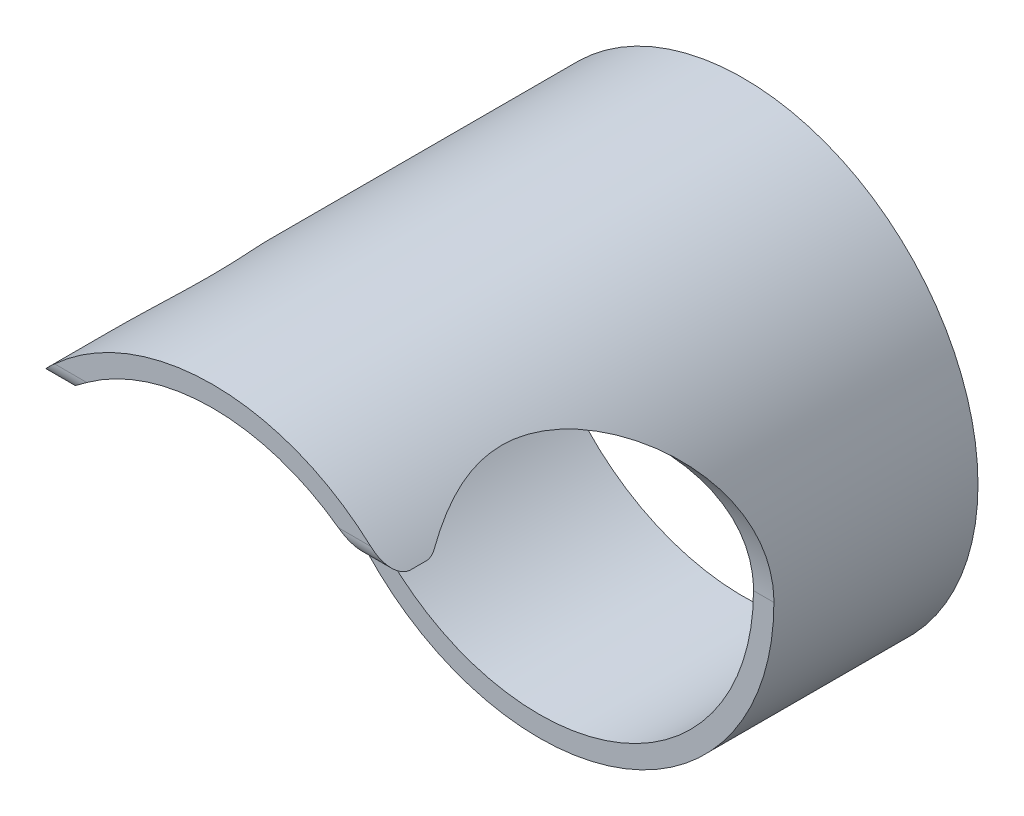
from build123d import *

# Parameters (mm, degrees)
ESQUISSE1_R           = 57.5
ESQUISSE1_R_2         = 52.5
EXTRUSION1_DEPTH      = 130
EXTRUSION2_DEPTH      = 154.337862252
EXTRUSION2_DEPTH_BACK = 154.337862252
CONG_1_R              = 5


with BuildPart() as part:
    # Esquisse1 → Extrusion1 (new body)
    with BuildSketch(Plane.XY):
        Circle(ESQUISSE1_R)
        Circle(ESQUISSE1_R_2, mode=Mode.SUBTRACT)
    extrude(amount=EXTRUSION1_DEPTH)

    # Esquisse2 → Extrusion2 (cut, two sides: drawn at the far end of the back side and taken through both)
    with BuildSketch(Plane(origin=(0, 0, 0), x_dir=(0, 0, -1), z_dir=(1, 0, 0)).offset(-EXTRUSION2_DEPTH_BACK)):
        with BuildLine():
            Line((-50, 0), (-50, -57.5))
            Line((-50, -57.5), (-130, -57.5))
            Line((-130, -57.5), (-130, 37.5))
            Line((-130, 37.5), (-119.874685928, 37.5))
            ThreePointArc((-119.874685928, 37.5), (-73.720442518, 39.650730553), (-50, 0))
        make_face()
    extrude(amount=EXTRUSION2_DEPTH + EXTRUSION2_DEPTH_BACK, mode=Mode.SUBTRACT)

    # Cong_1
    cong_1_edges = [part.edges().sort_by_distance(p)[0] for p in [
        (40.165667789, 37.5, 119.874685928),
        (-40.165667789, 37.5, 119.874685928),
        (40.165667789, 37.5, 130),
        (-40.165667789, 37.5, 130),
    ]]
    fillet(cong_1_edges, radius=CONG_1_R)


solid = part.part
